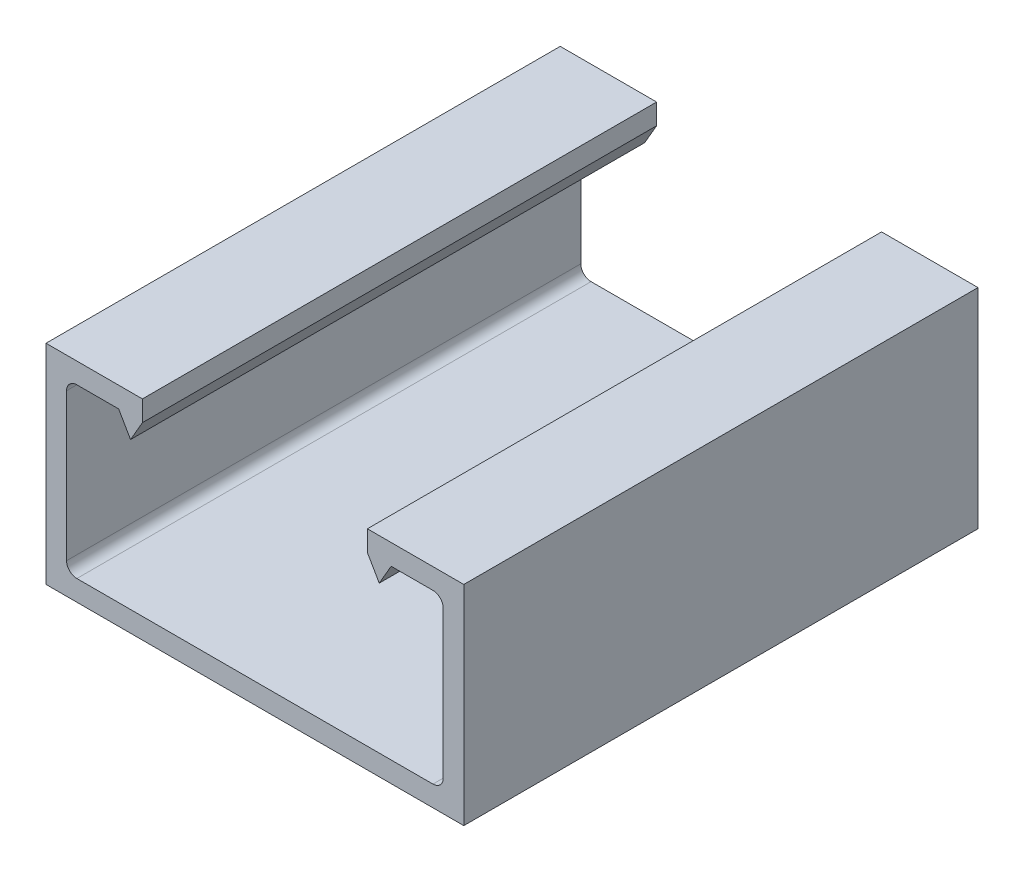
from build123d import *

# Parameters (mm, degrees)
BASE_EXTRUDE_DEPTH = 12.7


with BuildPart() as part:
    # Sketch1 → Base-Extrude (new, symmetric)
    with BuildSketch(Plane.XY):
        with BuildLine():
            Line((-5.55625, 5.159375), (-10.31875, 5.159375))
            Line((-10.31875, 5.159375), (-10.31875, -5.159375))
            Line((-10.31875, -5.159375), (10.31875, -5.159375))
            Line((10.31875, -5.159375), (10.31875, 5.159375))
            Line((10.31875, 5.159375), (5.55625, 5.159375))
            Line((5.55625, 5.159375), (5.55625, 4.143375))
            Line((5.55625, 4.143375), (6.142837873, 3.127375))
            Line((6.142837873, 3.127375), (6.729425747, 4.143375))
            Line((6.729425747, 4.143375), (8.79475, 4.143375))
            ThreePointArc((8.79475, 4.143375), (9.153960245, 3.994585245), (9.30275, 3.635375))
            Line((9.30275, 3.635375), (9.30275, -3.635375))
            ThreePointArc((9.30275, -3.635375), (9.153960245, -3.994585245), (8.79475, -4.143375))
            Line((8.79475, -4.143375), (-8.79475, -4.143375))
            ThreePointArc((-8.79475, -4.143375), (-9.153960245, -3.994585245), (-9.30275, -3.635375))
            Line((-9.30275, -3.635375), (-9.30275, 3.635375))
            ThreePointArc((-9.30275, 3.635375), (-9.153960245, 3.994585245), (-8.79475, 4.143375))
            Line((-8.79475, 4.143375), (-6.729425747, 4.143375))
            Line((-6.729425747, 4.143375), (-6.142837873, 3.127375))
            Line((-6.142837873, 3.127375), (-5.55625, 4.143375))
            Line((-5.55625, 4.143375), (-5.55625, 5.159375))
        make_face()
    extrude(amount=BASE_EXTRUDE_DEPTH, both=True)


solid = part.part
